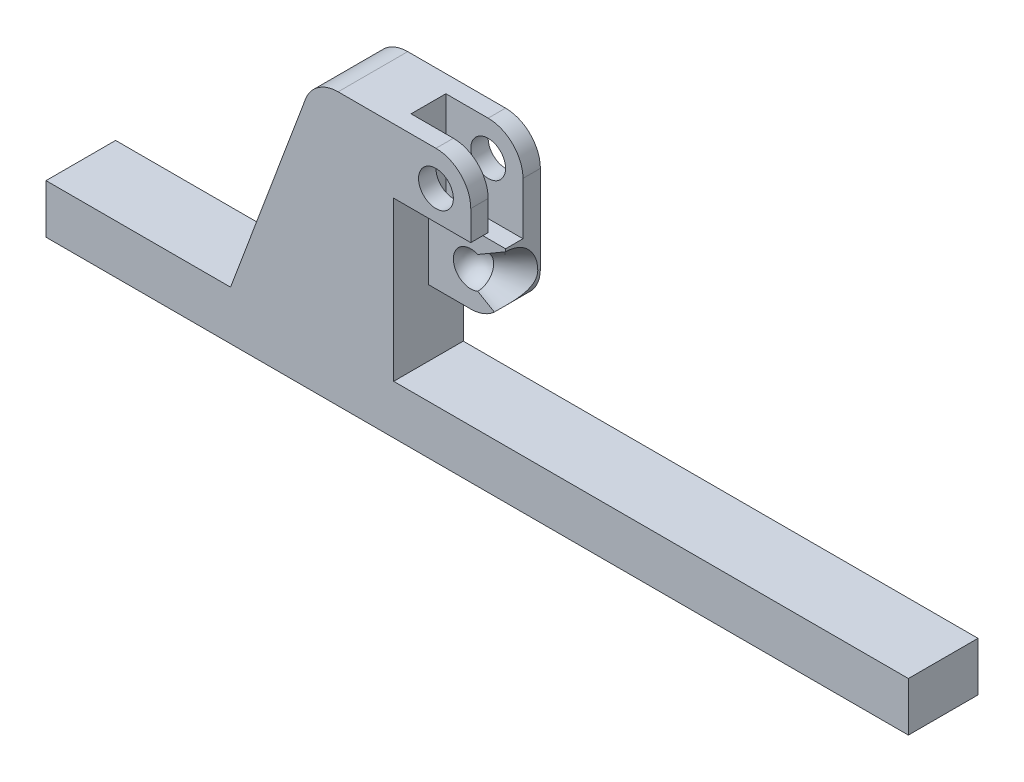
ISO-10303-21;
HEADER;
FILE_DESCRIPTION(('STEP AP214'),'2;1');
FILE_NAME('part.step','',(''),(''),'','','');
FILE_SCHEMA(('AUTOMOTIVE_DESIGN { 1 0 10303 214 1 1 1 1 }'));
ENDSEC;
DATA;
#1=APPLICATION_CONTEXT('core data for automotive mechanical design processes');
#2=APPLICATION_PROTOCOL_DEFINITION('international standard','automotive_design',2000,#1);
#3=PRODUCT_CONTEXT('',#1,'mechanical');
#4=PRODUCT('Part','Part','',(#3));
#5=PRODUCT_RELATED_PRODUCT_CATEGORY('part','',(#4));
#6=PRODUCT_DEFINITION_FORMATION('','',#4);
#7=PRODUCT_DEFINITION_CONTEXT('part definition',#1,'design');
#8=PRODUCT_DEFINITION('design','',#6,#7);
#9=PRODUCT_DEFINITION_SHAPE('','',#8);
#10=(LENGTH_UNIT() NAMED_UNIT(*) SI_UNIT(.MILLI.,.METRE.));
#11=(NAMED_UNIT(*) PLANE_ANGLE_UNIT() SI_UNIT($,.RADIAN.));
#12=(NAMED_UNIT(*) SI_UNIT($,.STERADIAN.) SOLID_ANGLE_UNIT());
#13=UNCERTAINTY_MEASURE_WITH_UNIT(LENGTH_MEASURE(1.E-05),#10,'distance_accuracy_value','');
#14=(GEOMETRIC_REPRESENTATION_CONTEXT(3) GLOBAL_UNCERTAINTY_ASSIGNED_CONTEXT((#13)) GLOBAL_UNIT_ASSIGNED_CONTEXT((#10,
#11,#12)) REPRESENTATION_CONTEXT('',''));
#15=CARTESIAN_POINT('',(0.,0.,0.));
#16=DIRECTION('',(0.,0.,1.));
#17=DIRECTION('',(1.,0.,0.));
#18=AXIS2_PLACEMENT_3D('',#15,#16,#17);
#19=CARTESIAN_POINT('',(10.,25.,10.));
#20=DIRECTION('',(-1.,0.,0.));
#21=DIRECTION('',(0.,-1.,0.));
#22=AXIS2_PLACEMENT_3D('',#19,#20,#21);
#23=PLANE('',#22);
#24=DIRECTION('',(0.,0.,-1.));
#25=VECTOR('',#24,1.);
#26=CARTESIAN_POINT('',(10.,16.5267560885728,10.));
#27=LINE('',#26,#25);
#28=CARTESIAN_POINT('',(9.99999999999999,16.5267560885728,10.));
#29=VERTEX_POINT('',#28);
#30=CARTESIAN_POINT('',(9.99999999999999,16.5267560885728,5.));
#31=VERTEX_POINT('',#30);
#32=EDGE_CURVE('E244',#29,#31,#27,.T.);
#33=ORIENTED_EDGE('',*,*,#32,.T.);
#34=DIRECTION('',(0.,1.,0.));
#35=VECTOR('',#34,1.);
#36=CARTESIAN_POINT('',(10.,25.,5.));
#37=LINE('',#36,#35);
#38=CARTESIAN_POINT('',(10.,25.,5.));
#39=VERTEX_POINT('',#38);
#40=EDGE_CURVE('E213',#31,#39,#37,.T.);
#41=ORIENTED_EDGE('',*,*,#40,.T.);
#42=DIRECTION('',(0.,0.,-1.));
#43=VECTOR('',#42,1.);
#44=CARTESIAN_POINT('',(10.,25.,10.));
#45=LINE('',#44,#43);
#46=CARTESIAN_POINT('',(10.,25.,10.));
#47=VERTEX_POINT('',#46);
#48=EDGE_CURVE('E378',#47,#39,#45,.T.);
#49=ORIENTED_EDGE('',*,*,#48,.F.);
#50=DIRECTION('',(0.,1.,0.));
#51=VECTOR('',#50,1.);
#52=CARTESIAN_POINT('',(10.,25.,10.));
#53=LINE('',#52,#51);
#54=EDGE_CURVE('E315',#29,#47,#53,.T.);
#55=ORIENTED_EDGE('',*,*,#54,.F.);
#56=EDGE_LOOP('',(#33,#41,#49,#55));
#57=FACE_BOUND('',#56,.T.);
#58=ADVANCED_FACE('F33',(#57),#23,.F.);
#59=CARTESIAN_POINT('',(0.,25.,10.));
#60=DIRECTION('',(0.,0.,-1.));
#61=DIRECTION('',(-1.,0.,0.));
#62=AXIS2_PLACEMENT_3D('',#59,#60,#61);
#63=CYLINDRICAL_SURFACE('',#62,10.);
#64=ORIENTED_EDGE('',*,*,#48,.T.);
#65=CARTESIAN_POINT('',(0.,25.,5.));
#66=DIRECTION('',(0.,0.,1.));
#67=DIRECTION('',(1.,0.,0.));
#68=AXIS2_PLACEMENT_3D('',#65,#66,#67);
#69=CIRCLE('',#68,10.);
#70=CARTESIAN_POINT('',(0.,35.,5.));
#71=VERTEX_POINT('',#70);
#72=EDGE_CURVE('E216',#39,#71,#69,.T.);
#73=ORIENTED_EDGE('',*,*,#72,.T.);
#74=DIRECTION('',(0.,0.,-1.));
#75=VECTOR('',#74,1.);
#76=CARTESIAN_POINT('',(0.,35.,10.));
#77=LINE('',#76,#75);
#78=CARTESIAN_POINT('',(0.,35.,10.));
#79=VERTEX_POINT('',#78);
#80=EDGE_CURVE('E374',#79,#71,#77,.T.);
#81=ORIENTED_EDGE('',*,*,#80,.F.);
#82=CARTESIAN_POINT('',(0.,25.,10.));
#83=DIRECTION('',(0.,0.,1.));
#84=DIRECTION('',(1.,0.,0.));
#85=AXIS2_PLACEMENT_3D('',#82,#83,#84);
#86=CIRCLE('',#85,10.);
#87=EDGE_CURVE('E328',#47,#79,#86,.T.);
#88=ORIENTED_EDGE('',*,*,#87,.F.);
#89=EDGE_LOOP('',(#64,#73,#81,#88));
#90=FACE_BOUND('',#89,.T.);
#91=ADVANCED_FACE('F298',(#90),#63,.T.);
#92=CARTESIAN_POINT('',(0.,25.,10.));
#93=DIRECTION('',(0.,0.,-1.));
#94=DIRECTION('',(-1.,0.,0.));
#95=AXIS2_PLACEMENT_3D('',#92,#93,#94);
#96=CYLINDRICAL_SURFACE('',#95,5.);
#97=CARTESIAN_POINT('',(0.,25.,5.));
#98=DIRECTION('',(0.,0.,1.));
#99=DIRECTION('',(1.,0.,0.));
#100=AXIS2_PLACEMENT_3D('',#97,#98,#99);
#101=CIRCLE('',#100,5.);
#102=CARTESIAN_POINT('',(5.,25.,5.));
#103=VERTEX_POINT('',#102);
#104=EDGE_CURVE('E219',#103,#103,#101,.T.);
#105=ORIENTED_EDGE('',*,*,#104,.F.);
#106=EDGE_LOOP('',(#105));
#107=FACE_BOUND('',#106,.T.);
#108=CARTESIAN_POINT('',(0.,25.,10.));
#109=DIRECTION('',(0.,0.,1.));
#110=DIRECTION('',(1.,0.,0.));
#111=AXIS2_PLACEMENT_3D('',#108,#109,#110);
#112=CIRCLE('',#111,5.);
#113=CARTESIAN_POINT('',(5.,25.,10.));
#114=VERTEX_POINT('',#113);
#115=EDGE_CURVE('E258',#114,#114,#112,.T.);
#116=ORIENTED_EDGE('',*,*,#115,.T.);
#117=EDGE_LOOP('',(#116));
#118=FACE_BOUND('',#117,.T.);
#119=ADVANCED_FACE('F281',(#107,#118),#96,.F.);
#120=CARTESIAN_POINT('',(0.,0.,10.));
#121=DIRECTION('',(0.,0.,-1.));
#122=DIRECTION('',(-1.,0.,0.));
#123=AXIS2_PLACEMENT_3D('',#120,#121,#122);
#124=CYLINDRICAL_SURFACE('',#123,10.);
#125=CARTESIAN_POINT('',(9.94985426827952,1.00019999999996,9.16969233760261));
#126=CARTESIAN_POINT('',(9.96472880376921,0.85252013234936,9.19455796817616));
#127=CARTESIAN_POINT('',(9.97635169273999,0.703578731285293,9.21395458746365));
#128=CARTESIAN_POINT('',(9.99293898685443,0.404315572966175,9.24161103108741));
#129=CARTESIAN_POINT('',(9.99790409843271,0.253993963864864,9.24987203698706));
#130=CARTESIAN_POINT('',(10.0010151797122,-0.0460805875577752,9.25504938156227));
#131=CARTESIAN_POINT('',(9.9991989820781,-0.195832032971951,9.25202866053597));
#132=CARTESIAN_POINT('',(9.98888514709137,-0.494452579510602,9.23485128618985));
#133=CARTESIAN_POINT('',(9.98038779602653,-0.643321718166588,9.2206951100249));
#134=CARTESIAN_POINT('',(9.95691395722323,-0.939081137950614,9.18150604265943));
#135=CARTESIAN_POINT('',(9.94193814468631,-1.0859716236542,9.15647428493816));
#136=CARTESIAN_POINT('',(9.90584288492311,-1.37686986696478,9.09595720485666));
#137=CARTESIAN_POINT('',(9.88472077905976,-1.52087634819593,9.06046735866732));
#138=CARTESIAN_POINT('',(9.83677056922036,-1.80519926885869,8.97957802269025));
#139=CARTESIAN_POINT('',(9.80993874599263,-1.94551323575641,8.93417207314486));
#140=CARTESIAN_POINT('',(9.75110277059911,-2.22169863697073,8.83411335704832));
#141=CARTESIAN_POINT('',(9.71909749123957,-2.35756909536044,8.77945857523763));
#142=CARTESIAN_POINT('',(9.64010532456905,-2.66468036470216,8.6437642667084));
#143=CARTESIAN_POINT('',(9.59151407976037,-2.83419952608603,8.55974292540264));
#144=CARTESIAN_POINT('',(9.48782959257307,-3.1640206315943,8.37872833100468));
#145=CARTESIAN_POINT('',(9.43273462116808,-3.32432010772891,8.28173162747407));
#146=CARTESIAN_POINT('',(9.25940495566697,-3.79125687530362,7.97307178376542));
#147=CARTESIAN_POINT('',(9.13321553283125,-4.08359924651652,7.74389070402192));
#148=CARTESIAN_POINT('',(8.91252002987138,-4.53968504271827,7.32985504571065));
#149=CARTESIAN_POINT('',(8.8210942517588,-4.71428499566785,7.15490266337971));
#150=CARTESIAN_POINT('',(8.63558443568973,-5.04606178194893,6.79046923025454));
#151=CARTESIAN_POINT('',(8.5415006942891,-5.20324054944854,6.6009897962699));
#152=CARTESIAN_POINT('',(8.35301340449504,-5.50074905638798,6.20898792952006));
#153=CARTESIAN_POINT('',(8.25860959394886,-5.64105524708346,6.00644785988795));
#154=CARTESIAN_POINT('',(8.07199158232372,-5.90500318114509,5.58987450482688));
#155=CARTESIAN_POINT('',(7.97977718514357,-6.02864642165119,5.37584225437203));
#156=CARTESIAN_POINT('',(7.79781639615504,-6.26230767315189,4.93216205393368));
#157=CARTESIAN_POINT('',(7.70817848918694,-6.37193846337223,4.70226569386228));
#158=CARTESIAN_POINT('',(7.53634255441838,-6.57428021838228,4.23243055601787));
#159=CARTESIAN_POINT('',(7.45414503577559,-6.66699002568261,3.99249109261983));
#160=CARTESIAN_POINT('',(7.30006835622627,-6.83535003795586,3.50387459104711));
#161=CARTESIAN_POINT('',(7.22817481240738,-6.91102410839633,3.25521034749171));
#162=CARTESIAN_POINT('',(7.0973853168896,-7.04527651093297,2.74997201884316));
#163=CARTESIAN_POINT('',(7.03848707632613,-7.10385785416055,2.49339933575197));
#164=CARTESIAN_POINT('',(6.94284626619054,-7.19727498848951,2.00683574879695));
#165=CARTESIAN_POINT('',(6.90423962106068,-7.2341819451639,1.77760869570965));
#166=CARTESIAN_POINT('',(6.84048761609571,-7.29449566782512,1.31552907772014));
#167=CARTESIAN_POINT('',(6.81534090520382,-7.31790378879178,1.08267687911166));
#168=CARTESIAN_POINT('',(6.77961288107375,-7.35101681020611,0.615060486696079));
#169=CARTESIAN_POINT('',(6.76902024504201,-7.36073236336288,0.380297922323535));
#170=CARTESIAN_POINT('',(6.76284875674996,-7.36640318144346,-0.0895963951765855));
#171=CARTESIAN_POINT('',(6.76727007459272,-7.36235829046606,-0.324728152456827));
#172=CARTESIAN_POINT('',(6.79091336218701,-7.34055509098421,-0.793418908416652));
#173=CARTESIAN_POINT('',(6.81012415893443,-7.32280713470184,-1.02697896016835));
#174=CARTESIAN_POINT('',(6.86247721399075,-7.27376683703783,-1.49108158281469));
#175=CARTESIAN_POINT('',(6.89561979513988,-7.24247418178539,-1.72162408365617));
#176=CARTESIAN_POINT('',(6.97449663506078,-7.16654626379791,-2.1784472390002));
#177=CARTESIAN_POINT('',(7.0202389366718,-7.1219024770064,-2.40472507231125));
#178=CARTESIAN_POINT('',(7.12263715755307,-7.01949263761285,-2.85184631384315));
#179=CARTESIAN_POINT('',(7.17929740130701,-6.96172138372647,-3.07268752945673));
#180=CARTESIAN_POINT('',(7.30475619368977,-6.83002291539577,-3.51890841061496));
#181=CARTESIAN_POINT('',(7.37402105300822,-6.75543065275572,-3.74396005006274));
#182=CARTESIAN_POINT('',(7.52039873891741,-6.5920881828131,-4.18622024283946));
#183=CARTESIAN_POINT('',(7.59751170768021,-6.50333771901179,-4.40342865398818));
#184=CARTESIAN_POINT('',(7.75765051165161,-6.31145815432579,-4.82971632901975));
#185=CARTESIAN_POINT('',(7.84068775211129,-6.20830093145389,-5.03877864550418));
#186=CARTESIAN_POINT('',(8.01048502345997,-5.98761320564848,-5.44751464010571));
#187=CARTESIAN_POINT('',(8.09724413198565,-5.87008625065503,-5.64719061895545));
#188=CARTESIAN_POINT('',(8.28822082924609,-5.59801222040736,-6.07116990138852));
#189=CARTESIAN_POINT('',(8.3927863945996,-5.44060320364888,-6.29349318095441));
#190=CARTESIAN_POINT('',(8.60119215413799,-5.10476038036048,-6.7222130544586));
#191=CARTESIAN_POINT('',(8.70503208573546,-4.92631934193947,-6.92860412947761));
#192=CARTESIAN_POINT('',(8.90830155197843,-4.54840908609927,-7.3223470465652));
#193=CARTESIAN_POINT('',(9.00774339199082,-4.34900461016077,-7.50975418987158));
#194=CARTESIAN_POINT('',(9.19884435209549,-3.92868604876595,-7.86281446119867));
#195=CARTESIAN_POINT('',(9.29051056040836,-3.70779195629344,-8.02848747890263));
#196=CARTESIAN_POINT('',(9.47569121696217,-3.20820999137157,-8.35819936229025));
#197=CARTESIAN_POINT('',(9.56726495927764,-2.92588123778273,-8.5179549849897));
#198=CARTESIAN_POINT('',(9.68795861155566,-2.48332994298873,-8.72611709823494));
#199=CARTESIAN_POINT('',(9.72541538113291,-2.3326178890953,-8.7902648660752));
#200=CARTESIAN_POINT('',(9.79398922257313,-2.0254601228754,-8.90713535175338));
#201=CARTESIAN_POINT('',(9.82510932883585,-1.86901719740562,-8.95986353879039));
#202=CARTESIAN_POINT('',(9.88052899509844,-1.54972829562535,-9.05342819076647));
#203=CARTESIAN_POINT('',(9.90475952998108,-1.38683495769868,-9.09414445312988));
#204=CARTESIAN_POINT('',(9.9453249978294,-1.05737130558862,-9.16214885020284));
#205=CARTESIAN_POINT('',(9.96166395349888,-0.890802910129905,-9.18944382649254));
#206=CARTESIAN_POINT('',(9.98597172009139,-0.555513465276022,-9.23000530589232));
#207=CARTESIAN_POINT('',(9.99394826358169,-0.386794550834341,-9.24328476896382));
#208=CARTESIAN_POINT('',(10.0013091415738,-0.0487296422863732,-9.25554032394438));
#209=CARTESIAN_POINT('',(10.0006985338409,0.120615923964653,-9.25452483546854));
#210=CARTESIAN_POINT('',(9.99235227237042,0.408872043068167,-9.24062628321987));
#211=CARTESIAN_POINT('',(9.98675485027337,0.528033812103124,-9.23130455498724));
#212=CARTESIAN_POINT('',(9.97139521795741,0.765119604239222,-9.20568519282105));
#213=CARTESIAN_POINT('',(9.96164046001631,0.883045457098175,-9.18940004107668));
#214=CARTESIAN_POINT('',(9.94985426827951,1.0002,-9.1696923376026));
#215=B_SPLINE_CURVE_WITH_KNOTS('',3,(#125,#126,#127,#128,#129,#130,#131,#132,#133,#134,#135,
#136,#137,#138,#139,#140,#141,#142,#143,#144,#145,#146,#147,#148,#149,#150,#151,#152,#153,#154,
#155,#156,#157,#158,#159,#160,#161,#162,#163,#164,#165,#166,#167,#168,#169,#170,#171,#172,#173,
#174,#175,#176,#177,#178,#179,#180,#181,#182,#183,#184,#185,#186,#187,#188,#189,#190,#191,#192,
#193,#194,#195,#196,#197,#198,#199,#200,#201,#202,#203,#204,#205,#206,#207,#208,#209,#210,#211,
#212,#213,#214),.UNSPECIFIED.,.F.,.F.,(4,2,2,2,2,2,2,2,2,2,2,2,2,2,2,2,2,2,2,2,2,2,2,2,2,2,2,2,
2,2,2,2,2,2,2,2,2,2,2,2,2,2,2,2,4),(0.,0.451368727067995,0.902689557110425,1.35149625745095,
1.80028372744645,2.24902443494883,2.6979595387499,3.14718797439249,3.59651442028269,
4.18164867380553,4.76693883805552,5.93863652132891,6.72840327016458,7.51808224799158,
8.30885088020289,9.09954841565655,9.90877630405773,10.7180595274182,11.5262018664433,
12.3342017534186,13.0395547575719,13.7448369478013,14.4495701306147,15.1543112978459,
15.8585205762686,16.5627461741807,17.2674223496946,17.972378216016,18.7126959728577,
19.4530271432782,20.1948241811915,20.9364384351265,21.8106511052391,22.6851652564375,
23.5570538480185,24.4281388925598,25.4350559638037,25.9386313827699,26.4419650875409,
26.9501769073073,27.4581293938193,27.9656117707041,28.472795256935,28.8314978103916,
29.1895600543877),.UNSPECIFIED.);
#216=CARTESIAN_POINT('',(6.76497989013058,-7.36444479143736,0.));
#217=VERTEX_POINT('',#216);
#218=CARTESIAN_POINT('',(10.,0.,-9.25336020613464));
#219=VERTEX_POINT('',#218);
#220=EDGE_CURVE('E250',#217,#219,#215,.T.);
#221=ORIENTED_EDGE('',*,*,#220,.F.);
#222=CARTESIAN_POINT('',(0.,0.,0.));
#223=DIRECTION('',(0.,0.,-1.));
#224=DIRECTION('',(-1.,0.,0.));
#225=AXIS2_PLACEMENT_3D('',#222,#223,#224);
#226=CIRCLE('',#225,10.);
#227=CARTESIAN_POINT('',(0.,-10.,0.));
#228=VERTEX_POINT('',#227);
#229=EDGE_CURVE('E241',#217,#228,#226,.T.);
#230=ORIENTED_EDGE('',*,*,#229,.T.);
#231=DIRECTION('',(0.,0.,-1.));
#232=VECTOR('',#231,1.);
#233=CARTESIAN_POINT('',(0.,-10.,10.));
#234=LINE('',#233,#232);
#235=CARTESIAN_POINT('',(0.,-10.,-10.));
#236=VERTEX_POINT('',#235);
#237=EDGE_CURVE('E382',#228,#236,#234,.T.);
#238=ORIENTED_EDGE('',*,*,#237,.T.);
#239=CARTESIAN_POINT('',(0.,0.,-10.));
#240=DIRECTION('',(0.,0.,1.));
#241=DIRECTION('',(1.,0.,0.));
#242=AXIS2_PLACEMENT_3D('',#239,#240,#241);
#243=CIRCLE('',#242,10.);
#244=CARTESIAN_POINT('',(10.,0.,-10.));
#245=VERTEX_POINT('',#244);
#246=EDGE_CURVE('E359',#236,#245,#243,.T.);
#247=ORIENTED_EDGE('',*,*,#246,.T.);
#248=DIRECTION('',(0.,0.,-1.));
#249=VECTOR('',#248,1.);
#250=CARTESIAN_POINT('',(10.,0.,10.));
#251=LINE('',#250,#249);
#252=EDGE_CURVE('E380',#219,#245,#251,.T.);
#253=ORIENTED_EDGE('',*,*,#252,.F.);
#254=EDGE_LOOP('',(#221,#230,#238,#247,#253));
#255=FACE_BOUND('',#254,.T.);
#256=ADVANCED_FACE('F260',(#255),#124,.T.);
#257=CARTESIAN_POINT('',(10.,25.,-4.99999999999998));
#258=VERTEX_POINT('',#257);
#259=CARTESIAN_POINT('',(10.,25.,-10.));
#260=VERTEX_POINT('',#259);
#261=EDGE_CURVE('E377',#258,#260,#45,.T.);
#262=ORIENTED_EDGE('',*,*,#261,.F.);
#263=DIRECTION('',(0.,-1.,0.));
#264=VECTOR('',#263,1.);
#265=CARTESIAN_POINT('',(10.,25.,-4.99999999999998));
#266=LINE('',#265,#264);
#267=CARTESIAN_POINT('',(10.,10.,-4.99999999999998));
#268=VERTEX_POINT('',#267);
#269=EDGE_CURVE('E225',#258,#268,#266,.T.);
#270=ORIENTED_EDGE('',*,*,#269,.T.);
#271=DIRECTION('',(0.,0.,1.));
#272=VECTOR('',#271,1.);
#273=CARTESIAN_POINT('',(10.,10.,10.));
#274=LINE('',#273,#272);
#275=CARTESIAN_POINT('',(9.99999999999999,10.,0.));
#276=VERTEX_POINT('',#275);
#277=EDGE_CURVE('E185',#268,#276,#274,.T.);
#278=ORIENTED_EDGE('',*,*,#277,.T.);
#279=DIRECTION('',(0.,-1.,0.));
#280=VECTOR('',#279,1.);
#281=CARTESIAN_POINT('',(10.,25.,0.));
#282=LINE('',#281,#280);
#283=CARTESIAN_POINT('',(10.,9.25336020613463,0.));
#284=VERTEX_POINT('',#283);
#285=EDGE_CURVE('E239',#276,#284,#282,.T.);
#286=ORIENTED_EDGE('',*,*,#285,.T.);
#287=CARTESIAN_POINT('',(10.,0.,0.));
#288=DIRECTION('',(-1.,0.,0.));
#289=DIRECTION('',(0.,-1.,0.));
#290=AXIS2_PLACEMENT_3D('',#287,#288,#289);
#291=CIRCLE('',#290,9.25336020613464);
#292=EDGE_CURVE('E406',#219,#284,#291,.F.);
#293=ORIENTED_EDGE('',*,*,#292,.F.);
#294=ORIENTED_EDGE('',*,*,#252,.T.);
#295=DIRECTION('',(0.,1.,0.));
#296=VECTOR('',#295,1.);
#297=CARTESIAN_POINT('',(10.,25.,-10.));
#298=LINE('',#297,#296);
#299=EDGE_CURVE('E362',#245,#260,#298,.T.);
#300=ORIENTED_EDGE('',*,*,#299,.T.);
#301=EDGE_LOOP('',(#262,#270,#278,#286,#293,#294,#300));
#302=FACE_BOUND('',#301,.T.);
#303=ADVANCED_FACE('F286',(#302),#23,.F.);
#304=CARTESIAN_POINT('',(-28.1081818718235,25.,10.));
#305=DIRECTION('',(0.,0.,-1.));
#306=DIRECTION('',(-1.,0.,0.));
#307=AXIS2_PLACEMENT_3D('',#304,#305,#306);
#308=PLANE('',#307);
#309=DIRECTION('',(0.,1.,0.));
#310=VECTOR('',#309,1.);
#311=CARTESIAN_POINT('',(-12.1509787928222,-29.0566884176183,10.));
#312=LINE('',#311,#310);
#313=CARTESIAN_POINT('',(-12.1509787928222,-29.0566884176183,10.));
#314=VERTEX_POINT('',#313);
#315=CARTESIAN_POINT('',(-12.1509787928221,16.5267560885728,10.));
#316=VERTEX_POINT('',#315);
#317=EDGE_CURVE('E322',#314,#316,#312,.T.);
#318=ORIENTED_EDGE('',*,*,#317,.T.);
#319=DIRECTION('',(-1.,0.,0.));
#320=VECTOR('',#319,1.);
#321=CARTESIAN_POINT('',(-12.1509787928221,16.5267560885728,10.));
#322=LINE('',#321,#320);
#323=EDGE_CURVE('E227',#29,#316,#322,.T.);
#324=ORIENTED_EDGE('',*,*,#323,.F.);
#325=ORIENTED_EDGE('',*,*,#54,.T.);
#326=ORIENTED_EDGE('',*,*,#87,.T.);
#327=DIRECTION('',(-1.,0.,0.));
#328=VECTOR('',#327,1.);
#329=CARTESIAN_POINT('',(0.,35.,10.));
#330=LINE('',#329,#328);
#331=CARTESIAN_POINT('',(-28.1081818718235,35.,10.));
#332=VERTEX_POINT('',#331);
#333=EDGE_CURVE('E335',#79,#332,#330,.T.);
#334=ORIENTED_EDGE('',*,*,#333,.T.);
#335=CARTESIAN_POINT('',(-28.1081818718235,25.,10.));
#336=DIRECTION('',(0.,0.,1.));
#337=DIRECTION('',(-1.,0.,0.));
#338=AXIS2_PLACEMENT_3D('',#335,#336,#337);
#339=CIRCLE('',#338,10.);
#340=CARTESIAN_POINT('',(-37.4742881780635,28.5037198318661,10.));
#341=VERTEX_POINT('',#340);
#342=EDGE_CURVE('E370',#332,#341,#339,.T.);
#343=ORIENTED_EDGE('',*,*,#342,.T.);
#344=DIRECTION('',(-0.350371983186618,-0.936610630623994,0.));
#345=VECTOR('',#344,1.);
#346=CARTESIAN_POINT('',(-37.4742881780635,28.5037198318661,10.));
#347=LINE('',#346,#345);
#348=CARTESIAN_POINT('',(-59.0067732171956,-29.0566884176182,10.));
#349=VERTEX_POINT('',#348);
#350=EDGE_CURVE('E428',#341,#349,#347,.T.);
#351=ORIENTED_EDGE('',*,*,#350,.T.);
#352=DIRECTION('',(-1.,0.,0.));
#353=VECTOR('',#352,1.);
#354=CARTESIAN_POINT('',(-59.0067732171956,-29.0566884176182,10.));
#355=LINE('',#354,#353);
#356=CARTESIAN_POINT('',(-112.028230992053,-29.0566884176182,10.));
#357=VERTEX_POINT('',#356);
#358=EDGE_CURVE('E436',#349,#357,#355,.T.);
#359=ORIENTED_EDGE('',*,*,#358,.T.);
#360=DIRECTION('',(0.,-1.,0.));
#361=VECTOR('',#360,1.);
#362=CARTESIAN_POINT('',(-112.028230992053,-29.0566884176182,10.));
#363=LINE('',#362,#361);
#364=CARTESIAN_POINT('',(-112.028230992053,-43.144779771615,10.));
#365=VERTEX_POINT('',#364);
#366=EDGE_CURVE('E438',#357,#365,#363,.T.);
#367=ORIENTED_EDGE('',*,*,#366,.T.);
#368=DIRECTION('',(1.,0.,0.));
#369=VECTOR('',#368,1.);
#370=CARTESIAN_POINT('',(-112.028230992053,-43.144779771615,10.));
#371=LINE('',#370,#369);
#372=CARTESIAN_POINT('',(135.72308319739,-43.144779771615,10.));
#373=VERTEX_POINT('',#372);
#374=EDGE_CURVE('E442',#365,#373,#371,.T.);
#375=ORIENTED_EDGE('',*,*,#374,.T.);
#376=DIRECTION('',(0.,1.,0.));
#377=VECTOR('',#376,1.);
#378=CARTESIAN_POINT('',(135.72308319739,-43.144779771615,10.));
#379=LINE('',#378,#377);
#380=CARTESIAN_POINT('',(135.72308319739,-29.0566884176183,10.));
#381=VERTEX_POINT('',#380);
#382=EDGE_CURVE('E330',#373,#381,#379,.T.);
#383=ORIENTED_EDGE('',*,*,#382,.T.);
#384=DIRECTION('',(-1.,0.,0.));
#385=VECTOR('',#384,1.);
#386=CARTESIAN_POINT('',(135.72308319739,-29.0566884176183,10.));
#387=LINE('',#386,#385);
#388=EDGE_CURVE('E324',#381,#314,#387,.T.);
#389=ORIENTED_EDGE('',*,*,#388,.T.);
#390=EDGE_LOOP('',(#318,#324,#325,#326,#334,#343,#351,#359,#367,#375,#383,#389));
#391=FACE_BOUND('',#390,.T.);
#392=ORIENTED_EDGE('',*,*,#115,.F.);
#393=EDGE_LOOP('',(#392));
#394=FACE_BOUND('',#393,.T.);
#395=ADVANCED_FACE('F282',(#391,#394),#308,.F.);
#396=CARTESIAN_POINT('',(-28.1081818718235,25.,-10.));
#397=DIRECTION('',(0.,0.,-1.));
#398=DIRECTION('',(-1.,0.,0.));
#399=AXIS2_PLACEMENT_3D('',#396,#397,#398);
#400=PLANE('',#399);
#401=CARTESIAN_POINT('',(-28.1081818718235,25.,-10.));
#402=DIRECTION('',(0.,0.,1.));
#403=DIRECTION('',(-1.,0.,0.));
#404=AXIS2_PLACEMENT_3D('',#401,#402,#403);
#405=CIRCLE('',#404,10.);
#406=CARTESIAN_POINT('',(-28.1081818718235,35.,-10.));
#407=VERTEX_POINT('',#406);
#408=CARTESIAN_POINT('',(-37.4742881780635,28.5037198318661,-10.));
#409=VERTEX_POINT('',#408);
#410=EDGE_CURVE('E338',#407,#409,#405,.T.);
#411=ORIENTED_EDGE('',*,*,#410,.F.);
#412=DIRECTION('',(-1.,0.,0.));
#413=VECTOR('',#412,1.);
#414=CARTESIAN_POINT('',(0.,35.,-10.));
#415=LINE('',#414,#413);
#416=CARTESIAN_POINT('',(0.,35.,-10.));
#417=VERTEX_POINT('',#416);
#418=EDGE_CURVE('E368',#417,#407,#415,.T.);
#419=ORIENTED_EDGE('',*,*,#418,.F.);
#420=CARTESIAN_POINT('',(0.,25.,-10.));
#421=DIRECTION('',(0.,0.,1.));
#422=DIRECTION('',(1.,0.,0.));
#423=AXIS2_PLACEMENT_3D('',#420,#421,#422);
#424=CIRCLE('',#423,10.);
#425=EDGE_CURVE('E365',#260,#417,#424,.T.);
#426=ORIENTED_EDGE('',*,*,#425,.F.);
#427=ORIENTED_EDGE('',*,*,#299,.F.);
#428=ORIENTED_EDGE('',*,*,#246,.F.);
#429=DIRECTION('',(1.,0.,0.));
#430=VECTOR('',#429,1.);
#431=CARTESIAN_POINT('',(0.,-10.,-10.));
#432=LINE('',#431,#430);
#433=CARTESIAN_POINT('',(-12.1509787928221,-10.,-10.));
#434=VERTEX_POINT('',#433);
#435=EDGE_CURVE('E356',#434,#236,#432,.T.);
#436=ORIENTED_EDGE('',*,*,#435,.F.);
#437=DIRECTION('',(0.,1.,0.));
#438=VECTOR('',#437,1.);
#439=CARTESIAN_POINT('',(-12.1509787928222,-29.0566884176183,-10.));
#440=LINE('',#439,#438);
#441=CARTESIAN_POINT('',(-12.1509787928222,-29.0566884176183,-10.));
#442=VERTEX_POINT('',#441);
#443=EDGE_CURVE('E353',#442,#434,#440,.T.);
#444=ORIENTED_EDGE('',*,*,#443,.F.);
#445=DIRECTION('',(-1.,0.,0.));
#446=VECTOR('',#445,1.);
#447=CARTESIAN_POINT('',(135.72308319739,-29.0566884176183,-10.));
#448=LINE('',#447,#446);
#449=CARTESIAN_POINT('',(135.72308319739,-29.0566884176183,-10.));
#450=VERTEX_POINT('',#449);
#451=EDGE_CURVE('E351',#450,#442,#448,.T.);
#452=ORIENTED_EDGE('',*,*,#451,.F.);
#453=DIRECTION('',(0.,1.,0.));
#454=VECTOR('',#453,1.);
#455=CARTESIAN_POINT('',(135.72308319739,-43.144779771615,-10.));
#456=LINE('',#455,#454);
#457=CARTESIAN_POINT('',(135.72308319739,-43.144779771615,-10.));
#458=VERTEX_POINT('',#457);
#459=EDGE_CURVE('E349',#458,#450,#456,.T.);
#460=ORIENTED_EDGE('',*,*,#459,.F.);
#461=DIRECTION('',(1.,0.,0.));
#462=VECTOR('',#461,1.);
#463=CARTESIAN_POINT('',(-112.028230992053,-43.144779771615,-10.));
#464=LINE('',#463,#462);
#465=CARTESIAN_POINT('',(-112.028230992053,-43.144779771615,-10.));
#466=VERTEX_POINT('',#465);
#467=EDGE_CURVE('E347',#466,#458,#464,.T.);
#468=ORIENTED_EDGE('',*,*,#467,.F.);
#469=DIRECTION('',(0.,-1.,0.));
#470=VECTOR('',#469,1.);
#471=CARTESIAN_POINT('',(-112.028230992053,-29.0566884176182,-10.));
#472=LINE('',#471,#470);
#473=CARTESIAN_POINT('',(-112.028230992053,-29.0566884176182,-10.));
#474=VERTEX_POINT('',#473);
#475=EDGE_CURVE('E345',#474,#466,#472,.T.);
#476=ORIENTED_EDGE('',*,*,#475,.F.);
#477=DIRECTION('',(-1.,0.,0.));
#478=VECTOR('',#477,1.);
#479=CARTESIAN_POINT('',(-59.0067732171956,-29.0566884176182,-10.));
#480=LINE('',#479,#478);
#481=CARTESIAN_POINT('',(-59.0067732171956,-29.0566884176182,-10.));
#482=VERTEX_POINT('',#481);
#483=EDGE_CURVE('E343',#482,#474,#480,.T.);
#484=ORIENTED_EDGE('',*,*,#483,.F.);
#485=DIRECTION('',(-0.350371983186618,-0.936610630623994,0.));
#486=VECTOR('',#485,1.);
#487=CARTESIAN_POINT('',(-37.4742881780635,28.5037198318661,-10.));
#488=LINE('',#487,#486);
#489=EDGE_CURVE('E341',#409,#482,#488,.T.);
#490=ORIENTED_EDGE('',*,*,#489,.F.);
#491=EDGE_LOOP('',(#411,#419,#426,#427,#428,#436,#444,#452,#460,#468,#476,#484,#490));
#492=FACE_BOUND('',#491,.T.);
#493=CARTESIAN_POINT('',(0.,25.,-10.));
#494=DIRECTION('',(0.,0.,1.));
#495=DIRECTION('',(1.,0.,0.));
#496=AXIS2_PLACEMENT_3D('',#493,#494,#495);
#497=CIRCLE('',#496,5.);
#498=CARTESIAN_POINT('',(5.,25.,-10.));
#499=VERTEX_POINT('',#498);
#500=EDGE_CURVE('E257',#499,#499,#497,.T.);
#501=ORIENTED_EDGE('',*,*,#500,.T.);
#502=EDGE_LOOP('',(#501));
#503=FACE_BOUND('',#502,.T.);
#504=ADVANCED_FACE('F285',(#492,#503),#400,.T.);
#505=CARTESIAN_POINT('',(-28.1081818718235,25.,10.));
#506=DIRECTION('',(0.,0.,-1.));
#507=DIRECTION('',(-1.,0.,0.));
#508=AXIS2_PLACEMENT_3D('',#505,#506,#507);
#509=CYLINDRICAL_SURFACE('',#508,10.);
#510=ORIENTED_EDGE('',*,*,#410,.T.);
#511=DIRECTION('',(0.,0.,-1.));
#512=VECTOR('',#511,1.);
#513=CARTESIAN_POINT('',(-37.4742881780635,28.5037198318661,10.));
#514=LINE('',#513,#512);
#515=EDGE_CURVE('E403',#341,#409,#514,.T.);
#516=ORIENTED_EDGE('',*,*,#515,.F.);
#517=ORIENTED_EDGE('',*,*,#342,.F.);
#518=DIRECTION('',(0.,0.,-1.));
#519=VECTOR('',#518,1.);
#520=CARTESIAN_POINT('',(-28.1081818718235,35.,10.));
#521=LINE('',#520,#519);
#522=EDGE_CURVE('E337',#332,#407,#521,.T.);
#523=ORIENTED_EDGE('',*,*,#522,.T.);
#524=EDGE_LOOP('',(#510,#516,#517,#523));
#525=FACE_BOUND('',#524,.T.);
#526=ADVANCED_FACE('F35',(#525),#509,.T.);
#527=CARTESIAN_POINT('',(-37.4742881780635,28.5037198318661,10.));
#528=DIRECTION('',(0.936610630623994,-0.350371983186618,0.));
#529=DIRECTION('',(0.350371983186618,0.936610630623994,0.));
#530=AXIS2_PLACEMENT_3D('',#527,#528,#529);
#531=PLANE('',#530);
#532=ORIENTED_EDGE('',*,*,#489,.T.);
#533=DIRECTION('',(0.,0.,-1.));
#534=VECTOR('',#533,1.);
#535=CARTESIAN_POINT('',(-59.0067732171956,-29.0566884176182,10.));
#536=LINE('',#535,#534);
#537=EDGE_CURVE('E400',#349,#482,#536,.T.);
#538=ORIENTED_EDGE('',*,*,#537,.F.);
#539=ORIENTED_EDGE('',*,*,#350,.F.);
#540=ORIENTED_EDGE('',*,*,#515,.T.);
#541=EDGE_LOOP('',(#532,#538,#539,#540));
#542=FACE_BOUND('',#541,.T.);
#543=ADVANCED_FACE('F434',(#542),#531,.F.);
#544=CARTESIAN_POINT('',(-59.0067732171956,-29.0566884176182,10.));
#545=DIRECTION('',(0.,-1.,0.));
#546=DIRECTION('',(0.,0.,-1.));
#547=AXIS2_PLACEMENT_3D('',#544,#545,#546);
#548=PLANE('',#547);
#549=ORIENTED_EDGE('',*,*,#483,.T.);
#550=DIRECTION('',(0.,0.,-1.));
#551=VECTOR('',#550,1.);
#552=CARTESIAN_POINT('',(-112.028230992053,-29.0566884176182,10.));
#553=LINE('',#552,#551);
#554=EDGE_CURVE('E397',#357,#474,#553,.T.);
#555=ORIENTED_EDGE('',*,*,#554,.F.);
#556=ORIENTED_EDGE('',*,*,#358,.F.);
#557=ORIENTED_EDGE('',*,*,#537,.T.);
#558=EDGE_LOOP('',(#549,#555,#556,#557));
#559=FACE_BOUND('',#558,.T.);
#560=ADVANCED_FACE('F468',(#559),#548,.F.);
#561=CARTESIAN_POINT('',(-112.028230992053,-29.0566884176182,10.));
#562=DIRECTION('',(1.,0.,0.));
#563=DIRECTION('',(0.,0.,-1.));
#564=AXIS2_PLACEMENT_3D('',#561,#562,#563);
#565=PLANE('',#564);
#566=ORIENTED_EDGE('',*,*,#475,.T.);
#567=DIRECTION('',(0.,0.,-1.));
#568=VECTOR('',#567,1.);
#569=CARTESIAN_POINT('',(-112.028230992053,-43.144779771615,10.));
#570=LINE('',#569,#568);
#571=EDGE_CURVE('E394',#365,#466,#570,.T.);
#572=ORIENTED_EDGE('',*,*,#571,.F.);
#573=ORIENTED_EDGE('',*,*,#366,.F.);
#574=ORIENTED_EDGE('',*,*,#554,.T.);
#575=EDGE_LOOP('',(#566,#572,#573,#574));
#576=FACE_BOUND('',#575,.T.);
#577=ADVANCED_FACE('F471',(#576),#565,.F.);
#578=CARTESIAN_POINT('',(-112.028230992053,-43.144779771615,10.));
#579=DIRECTION('',(0.,1.,0.));
#580=DIRECTION('',(0.,0.,1.));
#581=AXIS2_PLACEMENT_3D('',#578,#579,#580);
#582=PLANE('',#581);
#583=ORIENTED_EDGE('',*,*,#467,.T.);
#584=DIRECTION('',(0.,0.,-1.));
#585=VECTOR('',#584,1.);
#586=CARTESIAN_POINT('',(135.72308319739,-43.144779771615,10.));
#587=LINE('',#586,#585);
#588=EDGE_CURVE('E391',#373,#458,#587,.T.);
#589=ORIENTED_EDGE('',*,*,#588,.F.);
#590=ORIENTED_EDGE('',*,*,#374,.F.);
#591=ORIENTED_EDGE('',*,*,#571,.T.);
#592=EDGE_LOOP('',(#583,#589,#590,#591));
#593=FACE_BOUND('',#592,.T.);
#594=ADVANCED_FACE('F474',(#593),#582,.F.);
#595=CARTESIAN_POINT('',(135.72308319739,-43.144779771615,10.));
#596=DIRECTION('',(-1.,0.,0.));
#597=DIRECTION('',(0.,0.,1.));
#598=AXIS2_PLACEMENT_3D('',#595,#596,#597);
#599=PLANE('',#598);
#600=ORIENTED_EDGE('',*,*,#459,.T.);
#601=DIRECTION('',(0.,0.,-1.));
#602=VECTOR('',#601,1.);
#603=CARTESIAN_POINT('',(135.72308319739,-29.0566884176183,10.));
#604=LINE('',#603,#602);
#605=EDGE_CURVE('E388',#381,#450,#604,.T.);
#606=ORIENTED_EDGE('',*,*,#605,.F.);
#607=ORIENTED_EDGE('',*,*,#382,.F.);
#608=ORIENTED_EDGE('',*,*,#588,.T.);
#609=EDGE_LOOP('',(#600,#606,#607,#608));
#610=FACE_BOUND('',#609,.T.);
#611=ADVANCED_FACE('F448',(#610),#599,.F.);
#612=CARTESIAN_POINT('',(135.72308319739,-29.0566884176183,10.));
#613=DIRECTION('',(0.,-1.,0.));
#614=DIRECTION('',(1.,0.,0.));
#615=AXIS2_PLACEMENT_3D('',#612,#613,#614);
#616=PLANE('',#615);
#617=ORIENTED_EDGE('',*,*,#451,.T.);
#618=DIRECTION('',(0.,0.,-1.));
#619=VECTOR('',#618,1.);
#620=CARTESIAN_POINT('',(-12.1509787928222,-29.0566884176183,10.));
#621=LINE('',#620,#619);
#622=EDGE_CURVE('E386',#314,#442,#621,.T.);
#623=ORIENTED_EDGE('',*,*,#622,.F.);
#624=ORIENTED_EDGE('',*,*,#388,.F.);
#625=ORIENTED_EDGE('',*,*,#605,.T.);
#626=EDGE_LOOP('',(#617,#623,#624,#625));
#627=FACE_BOUND('',#626,.T.);
#628=ADVANCED_FACE('F452',(#627),#616,.F.);
#629=CARTESIAN_POINT('',(-12.1509787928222,-29.0566884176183,10.));
#630=DIRECTION('',(-1.,0.,0.));
#631=DIRECTION('',(0.,-1.,0.));
#632=AXIS2_PLACEMENT_3D('',#629,#630,#631);
#633=PLANE('',#632);
#634=DIRECTION('',(0.,1.,0.));
#635=VECTOR('',#634,1.);
#636=CARTESIAN_POINT('',(-12.1509787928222,10.,5.));
#637=LINE('',#636,#635);
#638=CARTESIAN_POINT('',(-12.1509787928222,16.5267560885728,5.));
#639=VERTEX_POINT('',#638);
#640=CARTESIAN_POINT('',(-12.1509787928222,35.,5.));
#641=VERTEX_POINT('',#640);
#642=EDGE_CURVE('E198',#639,#641,#637,.T.);
#643=ORIENTED_EDGE('',*,*,#642,.F.);
#644=DIRECTION('',(0.,0.,1.));
#645=VECTOR('',#644,1.);
#646=CARTESIAN_POINT('',(-12.1509787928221,16.5267560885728,0.));
#647=LINE('',#646,#645);
#648=EDGE_CURVE('E231',#639,#316,#647,.T.);
#649=ORIENTED_EDGE('',*,*,#648,.T.);
#650=ORIENTED_EDGE('',*,*,#317,.F.);
#651=ORIENTED_EDGE('',*,*,#622,.T.);
#652=ORIENTED_EDGE('',*,*,#443,.T.);
#653=DIRECTION('',(0.,0.,-1.));
#654=VECTOR('',#653,1.);
#655=CARTESIAN_POINT('',(-12.1509787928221,-10.,10.));
#656=LINE('',#655,#654);
#657=CARTESIAN_POINT('',(-12.1509787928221,-10.,0.));
#658=VERTEX_POINT('',#657);
#659=EDGE_CURVE('E384',#658,#434,#656,.T.);
#660=ORIENTED_EDGE('',*,*,#659,.F.);
#661=DIRECTION('',(0.,-1.,0.));
#662=VECTOR('',#661,1.);
#663=CARTESIAN_POINT('',(-12.1509787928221,-10.,0.));
#664=LINE('',#663,#662);
#665=CARTESIAN_POINT('',(-12.1509787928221,9.99999999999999,0.));
#666=VERTEX_POINT('',#665);
#667=EDGE_CURVE('E204',#666,#658,#664,.T.);
#668=ORIENTED_EDGE('',*,*,#667,.F.);
#669=DIRECTION('',(0.,0.,1.));
#670=VECTOR('',#669,1.);
#671=CARTESIAN_POINT('',(-12.1509787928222,10.,-4.99999999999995));
#672=LINE('',#671,#670);
#673=CARTESIAN_POINT('',(-12.1509787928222,10.,-4.99999999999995));
#674=VERTEX_POINT('',#673);
#675=EDGE_CURVE('E49',#674,#666,#672,.T.);
#676=ORIENTED_EDGE('',*,*,#675,.F.);
#677=DIRECTION('',(0.,1.,0.));
#678=VECTOR('',#677,1.);
#679=CARTESIAN_POINT('',(-12.1509787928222,10.,-4.99999999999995));
#680=LINE('',#679,#678);
#681=CARTESIAN_POINT('',(-12.1509787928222,35.,-4.99999999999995));
#682=VERTEX_POINT('',#681);
#683=EDGE_CURVE('E191',#674,#682,#680,.T.);
#684=ORIENTED_EDGE('',*,*,#683,.T.);
#685=DIRECTION('',(0.,0.,1.));
#686=VECTOR('',#685,1.);
#687=CARTESIAN_POINT('',(-12.1509787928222,35.,-4.99999999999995));
#688=LINE('',#687,#686);
#689=EDGE_CURVE('E208',#682,#641,#688,.T.);
#690=ORIENTED_EDGE('',*,*,#689,.T.);
#691=EDGE_LOOP('',(#643,#649,#650,#651,#652,#660,#668,#676,#684,#690));
#692=FACE_BOUND('',#691,.T.);
#693=ADVANCED_FACE('F202',(#692),#633,.F.);
#694=CARTESIAN_POINT('',(0.,-10.,10.));
#695=DIRECTION('',(0.,1.,0.));
#696=DIRECTION('',(-1.,0.,0.));
#697=AXIS2_PLACEMENT_3D('',#694,#695,#696);
#698=PLANE('',#697);
#699=ORIENTED_EDGE('',*,*,#237,.F.);
#700=DIRECTION('',(1.,0.,0.));
#701=VECTOR('',#700,1.);
#702=CARTESIAN_POINT('',(-12.1509787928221,-10.,0.));
#703=LINE('',#702,#701);
#704=EDGE_CURVE('E229',#658,#228,#703,.T.);
#705=ORIENTED_EDGE('',*,*,#704,.F.);
#706=ORIENTED_EDGE('',*,*,#659,.T.);
#707=ORIENTED_EDGE('',*,*,#435,.T.);
#708=EDGE_LOOP('',(#699,#705,#706,#707));
#709=FACE_BOUND('',#708,.T.);
#710=ADVANCED_FACE('F296',(#709),#698,.F.);
#711=CARTESIAN_POINT('',(0.,35.,-4.99999999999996));
#712=VERTEX_POINT('',#711);
#713=EDGE_CURVE('E373',#712,#417,#77,.T.);
#714=ORIENTED_EDGE('',*,*,#713,.F.);
#715=CARTESIAN_POINT('',(0.,25.,-4.99999999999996));
#716=DIRECTION('',(0.,0.,-1.));
#717=DIRECTION('',(-1.,0.,0.));
#718=AXIS2_PLACEMENT_3D('',#715,#716,#717);
#719=CIRCLE('',#718,10.);
#720=EDGE_CURVE('E222',#712,#258,#719,.T.);
#721=ORIENTED_EDGE('',*,*,#720,.T.);
#722=ORIENTED_EDGE('',*,*,#261,.T.);
#723=ORIENTED_EDGE('',*,*,#425,.T.);
#724=EDGE_LOOP('',(#714,#721,#722,#723));
#725=FACE_BOUND('',#724,.T.);
#726=ADVANCED_FACE('F293',(#725),#63,.T.);
#727=CARTESIAN_POINT('',(0.,35.,10.));
#728=DIRECTION('',(0.,-1.,0.));
#729=DIRECTION('',(0.,0.,-1.));
#730=AXIS2_PLACEMENT_3D('',#727,#728,#729);
#731=PLANE('',#730);
#732=ORIENTED_EDGE('',*,*,#80,.T.);
#733=DIRECTION('',(1.,0.,0.));
#734=VECTOR('',#733,1.);
#735=CARTESIAN_POINT('',(26.1164129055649,35.,5.));
#736=LINE('',#735,#734);
#737=EDGE_CURVE('E188',#641,#71,#736,.T.);
#738=ORIENTED_EDGE('',*,*,#737,.F.);
#739=ORIENTED_EDGE('',*,*,#689,.F.);
#740=DIRECTION('',(-1.,0.,0.));
#741=VECTOR('',#740,1.);
#742=CARTESIAN_POINT('',(26.1164129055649,35.,-5.));
#743=LINE('',#742,#741);
#744=EDGE_CURVE('E194',#712,#682,#743,.T.);
#745=ORIENTED_EDGE('',*,*,#744,.F.);
#746=ORIENTED_EDGE('',*,*,#713,.T.);
#747=ORIENTED_EDGE('',*,*,#418,.T.);
#748=ORIENTED_EDGE('',*,*,#522,.F.);
#749=ORIENTED_EDGE('',*,*,#333,.F.);
#750=EDGE_LOOP('',(#732,#738,#739,#745,#746,#747,#748,#749));
#751=FACE_BOUND('',#750,.T.);
#752=ADVANCED_FACE('F279',(#751),#731,.F.);
#753=CARTESIAN_POINT('',(0.,25.,-4.99999999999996));
#754=DIRECTION('',(0.,0.,-1.));
#755=DIRECTION('',(-1.,0.,0.));
#756=AXIS2_PLACEMENT_3D('',#753,#754,#755);
#757=CIRCLE('',#756,5.);
#758=CARTESIAN_POINT('',(-5.,25.,-4.99999999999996));
#759=VERTEX_POINT('',#758);
#760=EDGE_CURVE('E37',#759,#759,#757,.T.);
#761=ORIENTED_EDGE('',*,*,#760,.F.);
#762=EDGE_LOOP('',(#761));
#763=FACE_BOUND('',#762,.T.);
#764=ORIENTED_EDGE('',*,*,#500,.F.);
#765=EDGE_LOOP('',(#764));
#766=FACE_BOUND('',#765,.T.);
#767=ADVANCED_FACE('F270',(#763,#766),#96,.F.);
#768=CARTESIAN_POINT('',(12.8306885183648,0.,0.));
#769=DIRECTION('',(1.,0.,0.));
#770=DIRECTION('',(0.,0.,-1.));
#771=AXIS2_PLACEMENT_3D('',#768,#769,#770);
#772=CONICAL_SURFACE('',#771,10.9061880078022,0.528494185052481);
#773=DIRECTION('',(0.863567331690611,0.504233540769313,0.));
#774=VECTOR('',#773,1.);
#775=CARTESIAN_POINT('',(-5.84761610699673,0.,0.));
#776=LINE('',#775,#774);
#777=CARTESIAN_POINT('',(2.00037610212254,4.58241153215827,0.));
#778=VERTEX_POINT('',#777);
#779=EDGE_CURVE('E236',#778,#284,#776,.T.);
#780=ORIENTED_EDGE('',*,*,#779,.F.);
#781=CARTESIAN_POINT('',(2.00037610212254,0.,0.));
#782=DIRECTION('',(-1.,0.,0.));
#783=DIRECTION('',(0.,0.,1.));
#784=AXIS2_PLACEMENT_3D('',#781,#782,#783);
#785=CIRCLE('',#784,4.58241153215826);
#786=CARTESIAN_POINT('',(2.00037610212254,-4.58241153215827,0.));
#787=VERTEX_POINT('',#786);
#788=EDGE_CURVE('E247',#778,#787,#785,.T.);
#789=ORIENTED_EDGE('',*,*,#788,.T.);
#790=DIRECTION('',(-0.863567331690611,0.504233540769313,0.));
#791=VECTOR('',#790,1.);
#792=CARTESIAN_POINT('',(-5.84761610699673,0.,0.));
#793=LINE('',#792,#791);
#794=EDGE_CURVE('E57',#217,#787,#793,.T.);
#795=ORIENTED_EDGE('',*,*,#794,.F.);
#796=ORIENTED_EDGE('',*,*,#220,.T.);
#797=ORIENTED_EDGE('',*,*,#292,.T.);
#798=EDGE_LOOP('',(#780,#789,#795,#796,#797));
#799=FACE_BOUND('',#798,.T.);
#800=ADVANCED_FACE('F264',(#799),#772,.F.);
#801=CARTESIAN_POINT('',(0.,0.,0.));
#802=DIRECTION('',(-1.,0.,0.));
#803=DIRECTION('',(0.,1.,0.));
#804=AXIS2_PLACEMENT_3D('',#801,#802,#803);
#805=SPHERICAL_SURFACE('',#804,5.);
#806=CARTESIAN_POINT('',(0.,0.,0.));
#807=DIRECTION('',(0.,0.,-1.));
#808=DIRECTION('',(-1.,0.,0.));
#809=AXIS2_PLACEMENT_3D('',#806,#807,#808);
#810=CIRCLE('',#809,5.);
#811=EDGE_CURVE('E409',#787,#778,#810,.T.);
#812=ORIENTED_EDGE('',*,*,#811,.F.);
#813=ORIENTED_EDGE('',*,*,#788,.F.);
#814=EDGE_LOOP('',(#812,#813));
#815=FACE_BOUND('',#814,.T.);
#816=ADVANCED_FACE('F269',(#815),#805,.F.);
#817=CARTESIAN_POINT('',(-12.1509787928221,16.5267560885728,0.));
#818=DIRECTION('',(0.,1.,0.));
#819=DIRECTION('',(0.,0.,1.));
#820=AXIS2_PLACEMENT_3D('',#817,#818,#819);
#821=PLANE('',#820);
#822=ORIENTED_EDGE('',*,*,#648,.F.);
#823=DIRECTION('',(1.,0.,0.));
#824=VECTOR('',#823,1.);
#825=CARTESIAN_POINT('',(-12.1509787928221,16.5267560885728,5.));
#826=LINE('',#825,#824);
#827=EDGE_CURVE('E11',#639,#31,#826,.T.);
#828=ORIENTED_EDGE('',*,*,#827,.T.);
#829=ORIENTED_EDGE('',*,*,#32,.F.);
#830=ORIENTED_EDGE('',*,*,#323,.T.);
#831=EDGE_LOOP('',(#822,#828,#829,#830));
#832=FACE_BOUND('',#831,.T.);
#833=ADVANCED_FACE('F272',(#832),#821,.F.);
#834=CARTESIAN_POINT('',(-12.1509787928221,16.5267560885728,0.));
#835=DIRECTION('',(0.,0.,-1.));
#836=DIRECTION('',(-1.,0.,0.));
#837=AXIS2_PLACEMENT_3D('',#834,#835,#836);
#838=PLANE('',#837);
#839=ORIENTED_EDGE('',*,*,#285,.F.);
#840=DIRECTION('',(-1.,0.,0.));
#841=VECTOR('',#840,1.);
#842=CARTESIAN_POINT('',(-12.1509787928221,10.,0.));
#843=LINE('',#842,#841);
#844=EDGE_CURVE('E42',#276,#666,#843,.T.);
#845=ORIENTED_EDGE('',*,*,#844,.T.);
#846=ORIENTED_EDGE('',*,*,#667,.T.);
#847=ORIENTED_EDGE('',*,*,#704,.T.);
#848=ORIENTED_EDGE('',*,*,#229,.F.);
#849=ORIENTED_EDGE('',*,*,#794,.T.);
#850=ORIENTED_EDGE('',*,*,#811,.T.);
#851=ORIENTED_EDGE('',*,*,#779,.T.);
#852=EDGE_LOOP('',(#839,#845,#846,#847,#848,#849,#850,#851));
#853=FACE_BOUND('',#852,.T.);
#854=ADVANCED_FACE('F412',(#853),#838,.F.);
#855=CARTESIAN_POINT('',(26.1164129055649,10.,-5.));
#856=DIRECTION('',(0.,0.,-1.));
#857=DIRECTION('',(-1.,0.,0.));
#858=AXIS2_PLACEMENT_3D('',#855,#856,#857);
#859=PLANE('',#858);
#860=ORIENTED_EDGE('',*,*,#760,.T.);
#861=EDGE_LOOP('',(#860));
#862=FACE_BOUND('',#861,.T.);
#863=ORIENTED_EDGE('',*,*,#720,.F.);
#864=ORIENTED_EDGE('',*,*,#744,.T.);
#865=ORIENTED_EDGE('',*,*,#683,.F.);
#866=DIRECTION('',(-1.,0.,0.));
#867=VECTOR('',#866,1.);
#868=CARTESIAN_POINT('',(26.1164129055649,10.,-5.));
#869=LINE('',#868,#867);
#870=EDGE_CURVE('E181',#268,#674,#869,.T.);
#871=ORIENTED_EDGE('',*,*,#870,.F.);
#872=ORIENTED_EDGE('',*,*,#269,.F.);
#873=EDGE_LOOP('',(#863,#864,#865,#871,#872));
#874=FACE_BOUND('',#873,.T.);
#875=ADVANCED_FACE('F192',(#862,#874),#859,.F.);
#876=CARTESIAN_POINT('',(26.1164129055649,10.,5.));
#877=DIRECTION('',(0.,0.,1.));
#878=DIRECTION('',(1.,0.,0.));
#879=AXIS2_PLACEMENT_3D('',#876,#877,#878);
#880=PLANE('',#879);
#881=ORIENTED_EDGE('',*,*,#104,.T.);
#882=EDGE_LOOP('',(#881));
#883=FACE_BOUND('',#882,.T.);
#884=ORIENTED_EDGE('',*,*,#40,.F.);
#885=ORIENTED_EDGE('',*,*,#827,.F.);
#886=ORIENTED_EDGE('',*,*,#642,.T.);
#887=ORIENTED_EDGE('',*,*,#737,.T.);
#888=ORIENTED_EDGE('',*,*,#72,.F.);
#889=EDGE_LOOP('',(#884,#885,#886,#887,#888));
#890=FACE_BOUND('',#889,.T.);
#891=ADVANCED_FACE('F421',(#883,#890),#880,.F.);
#892=CARTESIAN_POINT('',(26.1164129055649,10.,5.));
#893=DIRECTION('',(0.,-1.,0.));
#894=DIRECTION('',(0.,0.,-1.));
#895=AXIS2_PLACEMENT_3D('',#892,#893,#894);
#896=PLANE('',#895);
#897=ORIENTED_EDGE('',*,*,#870,.T.);
#898=ORIENTED_EDGE('',*,*,#675,.T.);
#899=ORIENTED_EDGE('',*,*,#844,.F.);
#900=ORIENTED_EDGE('',*,*,#277,.F.);
#901=EDGE_LOOP('',(#897,#898,#899,#900));
#902=FACE_BOUND('',#901,.T.);
#903=ADVANCED_FACE('F183',(#902),#896,.F.);
#904=CLOSED_SHELL('',(#58,#91,#119,#256,#303,#395,#504,#526,#543,#560,#577,#594,#611,#628,#693,
#710,#726,#752,#767,#800,#816,#833,#854,#875,#891,#903));
#905=MANIFOLD_SOLID_BREP('B2',#904);
#906=ADVANCED_BREP_SHAPE_REPRESENTATION('',(#18,#905),#14);
#907=SHAPE_DEFINITION_REPRESENTATION(#9,#906);
ENDSEC;
END-ISO-10303-21;
